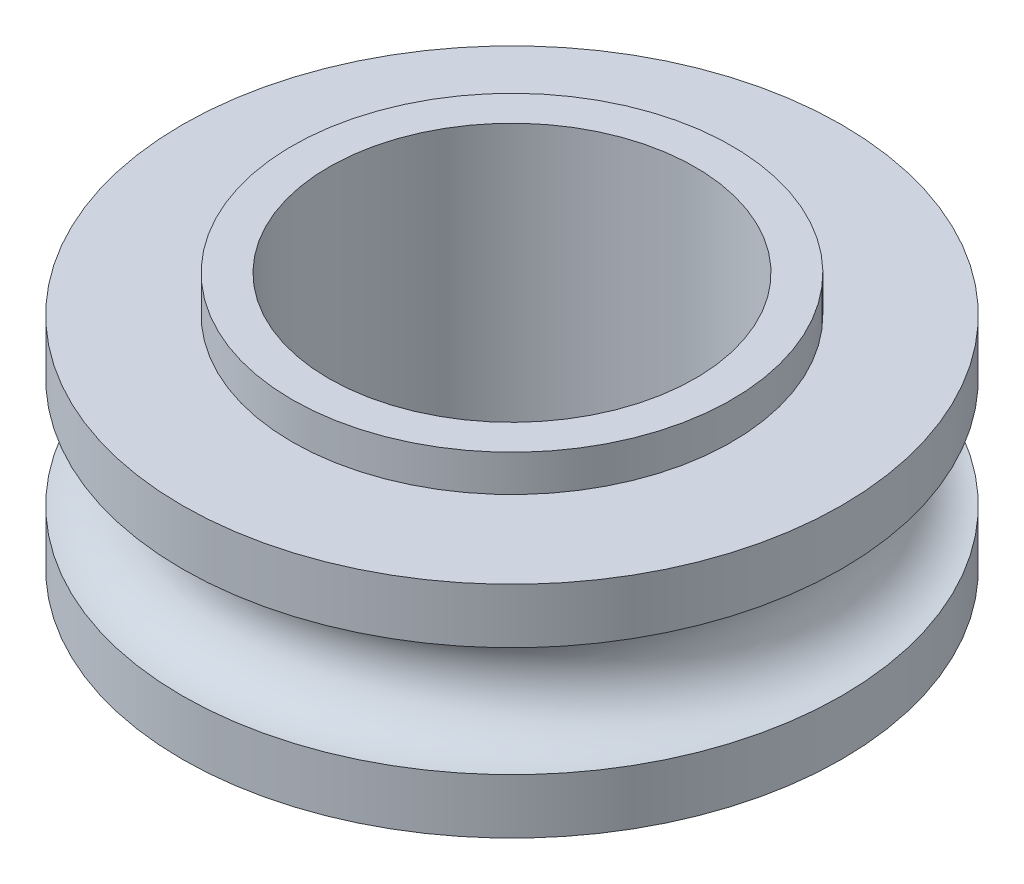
from build123d import *


with BuildPart() as part:
    # Sketch1 → Revolve1 (revolve)
    with BuildSketch(Plane.XY, mode=Mode.PRIVATE) as revolve1_sk:
        with BuildLine():
            Line((28.575, -4.7625), (28.575, -9.525))
            Line((28.575, -9.525), (19.05, -9.525))
            Line((19.05, -9.525), (19.05, -12.7))
            Line((19.05, -12.7), (15.875, -12.7))
            Line((15.875, -12.7), (15.875, -9.525))
            Line((15.875, -9.525), (15.875, 9.525))
            Line((15.875, 9.525), (15.875, 12.7))
            Line((15.875, 12.7), (19.05, 12.7))
            Line((19.05, 12.7), (19.05, 9.525))
            Line((19.05, 9.525), (28.575, 9.525))
            Line((28.575, 9.525), (28.575, 4.7625))
            ThreePointArc((28.575, 4.7625), (23.8125, 0), (28.575, -4.7625))
        make_face()
    revolve(revolve1_sk.sketch.rotate(Axis((0, 26.647321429, 0), (0, -1, 0)), 90), axis=Axis((0, 26.647321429, 0), (0, -1, 0)))


solid = part.part
